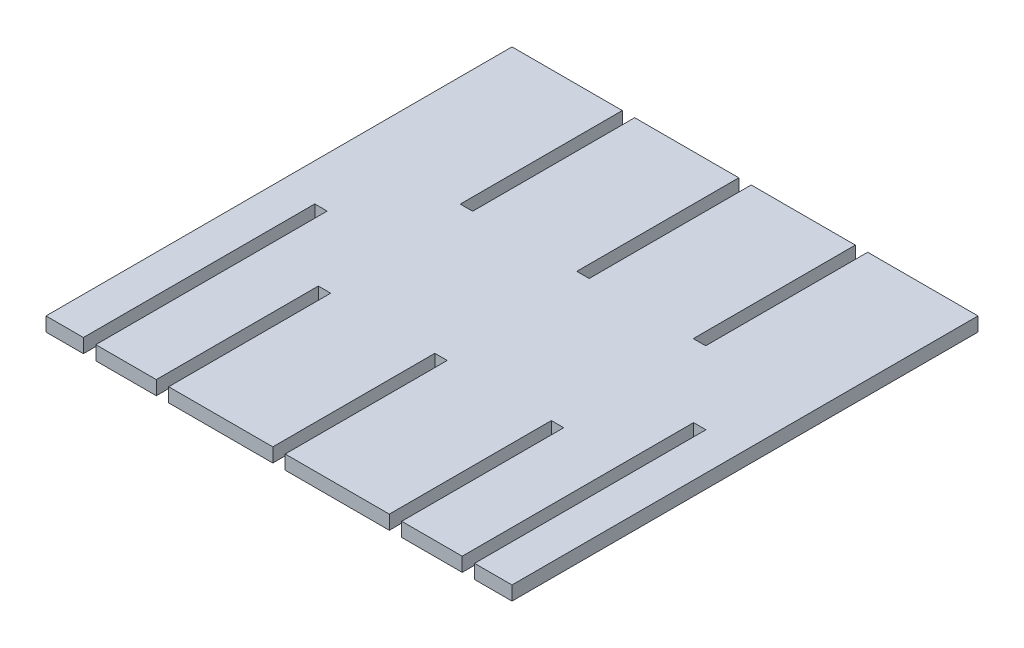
ISO-10303-21;
HEADER;
FILE_DESCRIPTION(('STEP AP214'),'2;1');
FILE_NAME('part.step','',(''),(''),'','','');
FILE_SCHEMA(('AUTOMOTIVE_DESIGN { 1 0 10303 214 1 1 1 1 }'));
ENDSEC;
DATA;
#1=APPLICATION_CONTEXT('core data for automotive mechanical design processes');
#2=APPLICATION_PROTOCOL_DEFINITION('international standard','automotive_design',2000,#1);
#3=PRODUCT_CONTEXT('',#1,'mechanical');
#4=PRODUCT('Part','Part','',(#3));
#5=PRODUCT_RELATED_PRODUCT_CATEGORY('part','',(#4));
#6=PRODUCT_DEFINITION_FORMATION('','',#4);
#7=PRODUCT_DEFINITION_CONTEXT('part definition',#1,'design');
#8=PRODUCT_DEFINITION('design','',#6,#7);
#9=PRODUCT_DEFINITION_SHAPE('','',#8);
#10=(LENGTH_UNIT() NAMED_UNIT(*) SI_UNIT(.MILLI.,.METRE.));
#11=(NAMED_UNIT(*) PLANE_ANGLE_UNIT() SI_UNIT($,.RADIAN.));
#12=(NAMED_UNIT(*) SI_UNIT($,.STERADIAN.) SOLID_ANGLE_UNIT());
#13=UNCERTAINTY_MEASURE_WITH_UNIT(LENGTH_MEASURE(1.E-05),#10,'distance_accuracy_value','');
#14=(GEOMETRIC_REPRESENTATION_CONTEXT(3) GLOBAL_UNCERTAINTY_ASSIGNED_CONTEXT((#13)) GLOBAL_UNIT_ASSIGNED_CONTEXT((#10,
#11,#12)) REPRESENTATION_CONTEXT('',''));
#15=CARTESIAN_POINT('',(0.,0.,0.));
#16=DIRECTION('',(0.,0.,1.));
#17=DIRECTION('',(1.,0.,0.));
#18=AXIS2_PLACEMENT_3D('',#15,#16,#17);
#19=CARTESIAN_POINT('',(0.,3.,0.));
#20=DIRECTION('',(1.,0.,0.));
#21=DIRECTION('',(0.,0.,-1.));
#22=AXIS2_PLACEMENT_3D('',#19,#20,#21);
#23=PLANE('',#22);
#24=DIRECTION('',(0.,0.,1.));
#25=VECTOR('',#24,1.);
#26=CARTESIAN_POINT('',(0.,0.,0.));
#27=LINE('',#26,#25);
#28=CARTESIAN_POINT('',(0.,0.,-99.65));
#29=VERTEX_POINT('',#28);
#30=CARTESIAN_POINT('',(0.,0.,0.));
#31=VERTEX_POINT('',#30);
#32=EDGE_CURVE('E305',#29,#31,#27,.T.);
#33=ORIENTED_EDGE('',*,*,#32,.T.);
#34=DIRECTION('',(0.,-1.,0.));
#35=VECTOR('',#34,1.);
#36=CARTESIAN_POINT('',(0.,3.,0.));
#37=LINE('',#36,#35);
#38=CARTESIAN_POINT('',(0.,3.,0.));
#39=VERTEX_POINT('',#38);
#40=EDGE_CURVE('E11',#39,#31,#37,.T.);
#41=ORIENTED_EDGE('',*,*,#40,.F.);
#42=DIRECTION('',(0.,0.,1.));
#43=VECTOR('',#42,1.);
#44=CARTESIAN_POINT('',(0.,3.,0.));
#45=LINE('',#44,#43);
#46=CARTESIAN_POINT('',(0.,3.,-99.65));
#47=VERTEX_POINT('',#46);
#48=EDGE_CURVE('E375',#47,#39,#45,.T.);
#49=ORIENTED_EDGE('',*,*,#48,.F.);
#50=DIRECTION('',(0.,-1.,0.));
#51=VECTOR('',#50,1.);
#52=CARTESIAN_POINT('',(0.,3.,-99.65));
#53=LINE('',#52,#51);
#54=EDGE_CURVE('E301',#47,#29,#53,.T.);
#55=ORIENTED_EDGE('',*,*,#54,.T.);
#56=EDGE_LOOP('',(#33,#41,#49,#55));
#57=FACE_BOUND('',#56,.T.);
#58=ADVANCED_FACE('F41',(#57),#23,.F.);
#59=CARTESIAN_POINT('',(0.,3.,0.));
#60=DIRECTION('',(0.,0.,-1.));
#61=DIRECTION('',(-1.,0.,0.));
#62=AXIS2_PLACEMENT_3D('',#59,#60,#61);
#63=PLANE('',#62);
#64=DIRECTION('',(1.,0.,0.));
#65=VECTOR('',#64,1.);
#66=CARTESIAN_POINT('',(0.,0.,0.));
#67=LINE('',#66,#65);
#68=CARTESIAN_POINT('',(7.99999999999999,0.,0.));
#69=VERTEX_POINT('',#68);
#70=EDGE_CURVE('E308',#31,#69,#67,.T.);
#71=ORIENTED_EDGE('',*,*,#70,.T.);
#72=DIRECTION('',(0.,-1.,0.));
#73=VECTOR('',#72,1.);
#74=CARTESIAN_POINT('',(7.99999999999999,3.,0.));
#75=LINE('',#74,#73);
#76=CARTESIAN_POINT('',(7.99999999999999,3.,0.));
#77=VERTEX_POINT('',#76);
#78=EDGE_CURVE('E49',#77,#69,#75,.T.);
#79=ORIENTED_EDGE('',*,*,#78,.F.);
#80=DIRECTION('',(1.,0.,0.));
#81=VECTOR('',#80,1.);
#82=CARTESIAN_POINT('',(0.,3.,0.));
#83=LINE('',#82,#81);
#84=EDGE_CURVE('E184',#39,#77,#83,.T.);
#85=ORIENTED_EDGE('',*,*,#84,.F.);
#86=ORIENTED_EDGE('',*,*,#40,.T.);
#87=EDGE_LOOP('',(#71,#79,#85,#86));
#88=FACE_BOUND('',#87,.T.);
#89=ADVANCED_FACE('F573',(#88),#63,.F.);
#90=CARTESIAN_POINT('',(7.99999999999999,3.,0.));
#91=DIRECTION('',(-1.,0.,0.));
#92=DIRECTION('',(0.,0.,1.));
#93=AXIS2_PLACEMENT_3D('',#90,#91,#92);
#94=PLANE('',#93);
#95=DIRECTION('',(0.,0.,-1.));
#96=VECTOR('',#95,1.);
#97=CARTESIAN_POINT('',(7.99999999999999,0.,0.));
#98=LINE('',#97,#96);
#99=CARTESIAN_POINT('',(7.99999999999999,0.,-49.475));
#100=VERTEX_POINT('',#99);
#101=EDGE_CURVE('E310',#69,#100,#98,.T.);
#102=ORIENTED_EDGE('',*,*,#101,.T.);
#103=DIRECTION('',(0.,-1.,0.));
#104=VECTOR('',#103,1.);
#105=CARTESIAN_POINT('',(7.99999999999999,3.,-49.475));
#106=LINE('',#105,#104);
#107=CARTESIAN_POINT('',(7.99999999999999,3.,-49.475));
#108=VERTEX_POINT('',#107);
#109=EDGE_CURVE('E466',#108,#100,#106,.T.);
#110=ORIENTED_EDGE('',*,*,#109,.F.);
#111=DIRECTION('',(0.,0.,-1.));
#112=VECTOR('',#111,1.);
#113=CARTESIAN_POINT('',(7.99999999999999,3.,0.));
#114=LINE('',#113,#112);
#115=EDGE_CURVE('E474',#77,#108,#114,.T.);
#116=ORIENTED_EDGE('',*,*,#115,.F.);
#117=ORIENTED_EDGE('',*,*,#78,.T.);
#118=EDGE_LOOP('',(#102,#110,#116,#117));
#119=FACE_BOUND('',#118,.T.);
#120=ADVANCED_FACE('F472',(#119),#94,.F.);
#121=CARTESIAN_POINT('',(7.99999999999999,3.,-49.475));
#122=DIRECTION('',(0.,0.,-1.));
#123=DIRECTION('',(-1.,0.,0.));
#124=AXIS2_PLACEMENT_3D('',#121,#122,#123);
#125=PLANE('',#124);
#126=DIRECTION('',(1.,0.,0.));
#127=VECTOR('',#126,1.);
#128=CARTESIAN_POINT('',(7.99999999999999,0.,-49.475));
#129=LINE('',#128,#127);
#130=CARTESIAN_POINT('',(10.65,0.,-49.475));
#131=VERTEX_POINT('',#130);
#132=EDGE_CURVE('E312',#100,#131,#129,.T.);
#133=ORIENTED_EDGE('',*,*,#132,.T.);
#134=DIRECTION('',(0.,-1.,0.));
#135=VECTOR('',#134,1.);
#136=CARTESIAN_POINT('',(10.65,3.,-49.475));
#137=LINE('',#136,#135);
#138=CARTESIAN_POINT('',(10.65,3.,-49.475));
#139=VERTEX_POINT('',#138);
#140=EDGE_CURVE('E463',#139,#131,#137,.T.);
#141=ORIENTED_EDGE('',*,*,#140,.F.);
#142=DIRECTION('',(1.,0.,0.));
#143=VECTOR('',#142,1.);
#144=CARTESIAN_POINT('',(7.99999999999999,3.,-49.475));
#145=LINE('',#144,#143);
#146=EDGE_CURVE('E492',#108,#139,#145,.T.);
#147=ORIENTED_EDGE('',*,*,#146,.F.);
#148=ORIENTED_EDGE('',*,*,#109,.T.);
#149=EDGE_LOOP('',(#133,#141,#147,#148));
#150=FACE_BOUND('',#149,.T.);
#151=ADVANCED_FACE('F483',(#150),#125,.F.);
#152=CARTESIAN_POINT('',(10.65,3.,0.));
#153=DIRECTION('',(1.,0.,0.));
#154=DIRECTION('',(0.,0.,-1.));
#155=AXIS2_PLACEMENT_3D('',#152,#153,#154);
#156=PLANE('',#155);
#157=DIRECTION('',(0.,0.,1.));
#158=VECTOR('',#157,1.);
#159=CARTESIAN_POINT('',(10.65,0.,0.));
#160=LINE('',#159,#158);
#161=CARTESIAN_POINT('',(10.65,0.,0.));
#162=VERTEX_POINT('',#161);
#163=EDGE_CURVE('E314',#131,#162,#160,.T.);
#164=ORIENTED_EDGE('',*,*,#163,.T.);
#165=DIRECTION('',(0.,-1.,0.));
#166=VECTOR('',#165,1.);
#167=CARTESIAN_POINT('',(10.65,3.,0.));
#168=LINE('',#167,#166);
#169=CARTESIAN_POINT('',(10.65,3.,0.));
#170=VERTEX_POINT('',#169);
#171=EDGE_CURVE('E460',#170,#162,#168,.T.);
#172=ORIENTED_EDGE('',*,*,#171,.F.);
#173=DIRECTION('',(0.,0.,1.));
#174=VECTOR('',#173,1.);
#175=CARTESIAN_POINT('',(10.65,3.,0.));
#176=LINE('',#175,#174);
#177=EDGE_CURVE('E489',#139,#170,#176,.T.);
#178=ORIENTED_EDGE('',*,*,#177,.F.);
#179=ORIENTED_EDGE('',*,*,#140,.T.);
#180=EDGE_LOOP('',(#164,#172,#178,#179));
#181=FACE_BOUND('',#180,.T.);
#182=ADVANCED_FACE('F487',(#181),#156,.F.);
#183=CARTESIAN_POINT('',(10.65,3.,0.));
#184=DIRECTION('',(0.,0.,-1.));
#185=DIRECTION('',(-1.,0.,0.));
#186=AXIS2_PLACEMENT_3D('',#183,#184,#185);
#187=PLANE('',#186);
#188=DIRECTION('',(1.,0.,0.));
#189=VECTOR('',#188,1.);
#190=CARTESIAN_POINT('',(10.65,0.,0.));
#191=LINE('',#190,#189);
#192=CARTESIAN_POINT('',(23.585,0.,1.73980515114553E-13));
#193=VERTEX_POINT('',#192);
#194=EDGE_CURVE('E316',#162,#193,#191,.T.);
#195=ORIENTED_EDGE('',*,*,#194,.T.);
#196=DIRECTION('',(0.,-1.,0.));
#197=VECTOR('',#196,1.);
#198=CARTESIAN_POINT('',(23.585,3.,1.73980515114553E-13));
#199=LINE('',#198,#197);
#200=CARTESIAN_POINT('',(23.585,3.,1.73980515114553E-13));
#201=VERTEX_POINT('',#200);
#202=EDGE_CURVE('E457',#201,#193,#199,.T.);
#203=ORIENTED_EDGE('',*,*,#202,.F.);
#204=DIRECTION('',(1.,0.,0.));
#205=VECTOR('',#204,1.);
#206=CARTESIAN_POINT('',(10.65,3.,0.));
#207=LINE('',#206,#205);
#208=EDGE_CURVE('E491',#170,#201,#207,.T.);
#209=ORIENTED_EDGE('',*,*,#208,.F.);
#210=ORIENTED_EDGE('',*,*,#171,.T.);
#211=EDGE_LOOP('',(#195,#203,#209,#210));
#212=FACE_BOUND('',#211,.T.);
#213=ADVANCED_FACE('F586',(#212),#187,.F.);
#214=CARTESIAN_POINT('',(23.585,3.,1.73980515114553E-13));
#215=DIRECTION('',(-1.,0.,0.));
#216=DIRECTION('',(0.,0.,1.));
#217=AXIS2_PLACEMENT_3D('',#214,#215,#216);
#218=PLANE('',#217);
#219=DIRECTION('',(0.,0.,-1.));
#220=VECTOR('',#219,1.);
#221=CARTESIAN_POINT('',(23.585,0.,1.73980515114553E-13));
#222=LINE('',#221,#220);
#223=CARTESIAN_POINT('',(23.585,0.,-34.6499999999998));
#224=VERTEX_POINT('',#223);
#225=EDGE_CURVE('E318',#193,#224,#222,.T.);
#226=ORIENTED_EDGE('',*,*,#225,.T.);
#227=DIRECTION('',(0.,-1.,0.));
#228=VECTOR('',#227,1.);
#229=CARTESIAN_POINT('',(23.585,3.,-34.6499999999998));
#230=LINE('',#229,#228);
#231=CARTESIAN_POINT('',(23.585,3.,-34.6499999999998));
#232=VERTEX_POINT('',#231);
#233=EDGE_CURVE('E454',#232,#224,#230,.T.);
#234=ORIENTED_EDGE('',*,*,#233,.F.);
#235=DIRECTION('',(0.,0.,-1.));
#236=VECTOR('',#235,1.);
#237=CARTESIAN_POINT('',(23.585,3.,1.73980515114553E-13));
#238=LINE('',#237,#236);
#239=EDGE_CURVE('E494',#201,#232,#238,.T.);
#240=ORIENTED_EDGE('',*,*,#239,.F.);
#241=ORIENTED_EDGE('',*,*,#202,.T.);
#242=EDGE_LOOP('',(#226,#234,#240,#241));
#243=FACE_BOUND('',#242,.T.);
#244=ADVANCED_FACE('F589',(#243),#218,.F.);
#245=CARTESIAN_POINT('',(26.235,3.,-34.6499999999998));
#246=DIRECTION('',(0.,0.,-1.));
#247=DIRECTION('',(-1.,0.,0.));
#248=AXIS2_PLACEMENT_3D('',#245,#246,#247);
#249=PLANE('',#248);
#250=DIRECTION('',(1.,0.,0.));
#251=VECTOR('',#250,1.);
#252=CARTESIAN_POINT('',(26.235,0.,-34.6499999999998));
#253=LINE('',#252,#251);
#254=CARTESIAN_POINT('',(26.235,0.,-34.6499999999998));
#255=VERTEX_POINT('',#254);
#256=EDGE_CURVE('E320',#224,#255,#253,.T.);
#257=ORIENTED_EDGE('',*,*,#256,.T.);
#258=DIRECTION('',(0.,-1.,0.));
#259=VECTOR('',#258,1.);
#260=CARTESIAN_POINT('',(26.235,3.,-34.6499999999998));
#261=LINE('',#260,#259);
#262=CARTESIAN_POINT('',(26.235,3.,-34.6499999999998));
#263=VERTEX_POINT('',#262);
#264=EDGE_CURVE('E451',#263,#255,#261,.T.);
#265=ORIENTED_EDGE('',*,*,#264,.F.);
#266=DIRECTION('',(1.,0.,0.));
#267=VECTOR('',#266,1.);
#268=CARTESIAN_POINT('',(26.235,3.,-34.6499999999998));
#269=LINE('',#268,#267);
#270=EDGE_CURVE('E500',#232,#263,#269,.T.);
#271=ORIENTED_EDGE('',*,*,#270,.F.);
#272=ORIENTED_EDGE('',*,*,#233,.T.);
#273=EDGE_LOOP('',(#257,#265,#271,#272));
#274=FACE_BOUND('',#273,.T.);
#275=ADVANCED_FACE('F593',(#274),#249,.F.);
#276=CARTESIAN_POINT('',(26.235,3.,1.73980515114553E-13));
#277=DIRECTION('',(1.,0.,0.));
#278=DIRECTION('',(0.,0.,-1.));
#279=AXIS2_PLACEMENT_3D('',#276,#277,#278);
#280=PLANE('',#279);
#281=DIRECTION('',(0.,0.,1.));
#282=VECTOR('',#281,1.);
#283=CARTESIAN_POINT('',(26.235,0.,1.73980515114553E-13));
#284=LINE('',#283,#282);
#285=CARTESIAN_POINT('',(26.235,0.,1.73980515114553E-13));
#286=VERTEX_POINT('',#285);
#287=EDGE_CURVE('E322',#255,#286,#284,.T.);
#288=ORIENTED_EDGE('',*,*,#287,.T.);
#289=DIRECTION('',(0.,-1.,0.));
#290=VECTOR('',#289,1.);
#291=CARTESIAN_POINT('',(26.235,3.,1.73980515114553E-13));
#292=LINE('',#291,#290);
#293=CARTESIAN_POINT('',(26.235,3.,1.73980515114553E-13));
#294=VERTEX_POINT('',#293);
#295=EDGE_CURVE('E448',#294,#286,#292,.T.);
#296=ORIENTED_EDGE('',*,*,#295,.F.);
#297=DIRECTION('',(0.,0.,1.));
#298=VECTOR('',#297,1.);
#299=CARTESIAN_POINT('',(26.235,3.,1.73980515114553E-13));
#300=LINE('',#299,#298);
#301=EDGE_CURVE('E502',#263,#294,#300,.T.);
#302=ORIENTED_EDGE('',*,*,#301,.F.);
#303=ORIENTED_EDGE('',*,*,#264,.T.);
#304=EDGE_LOOP('',(#288,#296,#302,#303));
#305=FACE_BOUND('',#304,.T.);
#306=ADVANCED_FACE('F597',(#305),#280,.F.);
#307=CARTESIAN_POINT('',(26.235,3.,1.73980515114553E-13));
#308=DIRECTION('',(0.,0.,-1.));
#309=DIRECTION('',(-1.,0.,0.));
#310=AXIS2_PLACEMENT_3D('',#307,#308,#309);
#311=PLANE('',#310);
#312=DIRECTION('',(1.,0.,0.));
#313=VECTOR('',#312,1.);
#314=CARTESIAN_POINT('',(26.235,0.,1.73980515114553E-13));
#315=LINE('',#314,#313);
#316=CARTESIAN_POINT('',(48.5,0.,0.));
#317=VERTEX_POINT('',#316);
#318=EDGE_CURVE('E324',#286,#317,#315,.T.);
#319=ORIENTED_EDGE('',*,*,#318,.T.);
#320=DIRECTION('',(0.,-1.,0.));
#321=VECTOR('',#320,1.);
#322=CARTESIAN_POINT('',(48.5,3.,0.));
#323=LINE('',#322,#321);
#324=CARTESIAN_POINT('',(48.5,3.,0.));
#325=VERTEX_POINT('',#324);
#326=EDGE_CURVE('E445',#325,#317,#323,.T.);
#327=ORIENTED_EDGE('',*,*,#326,.F.);
#328=DIRECTION('',(1.,0.,0.));
#329=VECTOR('',#328,1.);
#330=CARTESIAN_POINT('',(26.235,3.,1.73980515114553E-13));
#331=LINE('',#330,#329);
#332=EDGE_CURVE('E504',#294,#325,#331,.T.);
#333=ORIENTED_EDGE('',*,*,#332,.F.);
#334=ORIENTED_EDGE('',*,*,#295,.T.);
#335=EDGE_LOOP('',(#319,#327,#333,#334));
#336=FACE_BOUND('',#335,.T.);
#337=ADVANCED_FACE('F601',(#336),#311,.F.);
#338=CARTESIAN_POINT('',(48.5,3.,0.));
#339=DIRECTION('',(-1.,0.,0.));
#340=DIRECTION('',(0.,0.,1.));
#341=AXIS2_PLACEMENT_3D('',#338,#339,#340);
#342=PLANE('',#341);
#343=DIRECTION('',(0.,0.,-1.));
#344=VECTOR('',#343,1.);
#345=CARTESIAN_POINT('',(48.5,0.,0.));
#346=LINE('',#345,#344);
#347=CARTESIAN_POINT('',(48.5,0.,-34.65));
#348=VERTEX_POINT('',#347);
#349=EDGE_CURVE('E326',#317,#348,#346,.T.);
#350=ORIENTED_EDGE('',*,*,#349,.T.);
#351=DIRECTION('',(0.,-1.,0.));
#352=VECTOR('',#351,1.);
#353=CARTESIAN_POINT('',(48.5,3.,-34.65));
#354=LINE('',#353,#352);
#355=CARTESIAN_POINT('',(48.5,3.,-34.65));
#356=VERTEX_POINT('',#355);
#357=EDGE_CURVE('E442',#356,#348,#354,.T.);
#358=ORIENTED_EDGE('',*,*,#357,.F.);
#359=DIRECTION('',(0.,0.,-1.));
#360=VECTOR('',#359,1.);
#361=CARTESIAN_POINT('',(48.5,3.,0.));
#362=LINE('',#361,#360);
#363=EDGE_CURVE('E506',#325,#356,#362,.T.);
#364=ORIENTED_EDGE('',*,*,#363,.F.);
#365=ORIENTED_EDGE('',*,*,#326,.T.);
#366=EDGE_LOOP('',(#350,#358,#364,#365));
#367=FACE_BOUND('',#366,.T.);
#368=ADVANCED_FACE('F605',(#367),#342,.F.);
#369=CARTESIAN_POINT('',(51.15,3.,-34.65));
#370=DIRECTION('',(0.,0.,-1.));
#371=DIRECTION('',(-1.,0.,0.));
#372=AXIS2_PLACEMENT_3D('',#369,#370,#371);
#373=PLANE('',#372);
#374=DIRECTION('',(1.,0.,0.));
#375=VECTOR('',#374,1.);
#376=CARTESIAN_POINT('',(51.15,0.,-34.65));
#377=LINE('',#376,#375);
#378=CARTESIAN_POINT('',(51.15,0.,-34.65));
#379=VERTEX_POINT('',#378);
#380=EDGE_CURVE('E328',#348,#379,#377,.T.);
#381=ORIENTED_EDGE('',*,*,#380,.T.);
#382=DIRECTION('',(0.,-1.,0.));
#383=VECTOR('',#382,1.);
#384=CARTESIAN_POINT('',(51.15,3.,-34.65));
#385=LINE('',#384,#383);
#386=CARTESIAN_POINT('',(51.15,3.,-34.65));
#387=VERTEX_POINT('',#386);
#388=EDGE_CURVE('E439',#387,#379,#385,.T.);
#389=ORIENTED_EDGE('',*,*,#388,.F.);
#390=DIRECTION('',(1.,0.,0.));
#391=VECTOR('',#390,1.);
#392=CARTESIAN_POINT('',(51.15,3.,-34.65));
#393=LINE('',#392,#391);
#394=EDGE_CURVE('E508',#356,#387,#393,.T.);
#395=ORIENTED_EDGE('',*,*,#394,.F.);
#396=ORIENTED_EDGE('',*,*,#357,.T.);
#397=EDGE_LOOP('',(#381,#389,#395,#396));
#398=FACE_BOUND('',#397,.T.);
#399=ADVANCED_FACE('F609',(#398),#373,.F.);
#400=CARTESIAN_POINT('',(51.15,3.,0.));
#401=DIRECTION('',(1.,0.,0.));
#402=DIRECTION('',(0.,0.,-1.));
#403=AXIS2_PLACEMENT_3D('',#400,#401,#402);
#404=PLANE('',#403);
#405=DIRECTION('',(0.,0.,1.));
#406=VECTOR('',#405,1.);
#407=CARTESIAN_POINT('',(51.15,0.,0.));
#408=LINE('',#407,#406);
#409=CARTESIAN_POINT('',(51.15,0.,0.));
#410=VERTEX_POINT('',#409);
#411=EDGE_CURVE('E330',#379,#410,#408,.T.);
#412=ORIENTED_EDGE('',*,*,#411,.T.);
#413=DIRECTION('',(0.,-1.,0.));
#414=VECTOR('',#413,1.);
#415=CARTESIAN_POINT('',(51.15,3.,0.));
#416=LINE('',#415,#414);
#417=CARTESIAN_POINT('',(51.15,3.,0.));
#418=VERTEX_POINT('',#417);
#419=EDGE_CURVE('E436',#418,#410,#416,.T.);
#420=ORIENTED_EDGE('',*,*,#419,.F.);
#421=DIRECTION('',(0.,0.,1.));
#422=VECTOR('',#421,1.);
#423=CARTESIAN_POINT('',(51.15,3.,0.));
#424=LINE('',#423,#422);
#425=EDGE_CURVE('E510',#387,#418,#424,.T.);
#426=ORIENTED_EDGE('',*,*,#425,.F.);
#427=ORIENTED_EDGE('',*,*,#388,.T.);
#428=EDGE_LOOP('',(#412,#420,#426,#427));
#429=FACE_BOUND('',#428,.T.);
#430=ADVANCED_FACE('F613',(#429),#404,.F.);
#431=CARTESIAN_POINT('',(51.15,3.,0.));
#432=DIRECTION('',(0.,0.,-1.));
#433=DIRECTION('',(-1.,0.,0.));
#434=AXIS2_PLACEMENT_3D('',#431,#432,#433);
#435=PLANE('',#434);
#436=DIRECTION('',(1.,0.,0.));
#437=VECTOR('',#436,1.);
#438=CARTESIAN_POINT('',(51.15,0.,0.));
#439=LINE('',#438,#437);
#440=CARTESIAN_POINT('',(73.415,0.,0.));
#441=VERTEX_POINT('',#440);
#442=EDGE_CURVE('E332',#410,#441,#439,.T.);
#443=ORIENTED_EDGE('',*,*,#442,.T.);
#444=DIRECTION('',(0.,-1.,0.));
#445=VECTOR('',#444,1.);
#446=CARTESIAN_POINT('',(73.415,3.,0.));
#447=LINE('',#446,#445);
#448=CARTESIAN_POINT('',(73.415,3.,0.));
#449=VERTEX_POINT('',#448);
#450=EDGE_CURVE('E433',#449,#441,#447,.T.);
#451=ORIENTED_EDGE('',*,*,#450,.F.);
#452=DIRECTION('',(1.,0.,0.));
#453=VECTOR('',#452,1.);
#454=CARTESIAN_POINT('',(51.15,3.,0.));
#455=LINE('',#454,#453);
#456=EDGE_CURVE('E512',#418,#449,#455,.T.);
#457=ORIENTED_EDGE('',*,*,#456,.F.);
#458=ORIENTED_EDGE('',*,*,#419,.T.);
#459=EDGE_LOOP('',(#443,#451,#457,#458));
#460=FACE_BOUND('',#459,.T.);
#461=ADVANCED_FACE('F617',(#460),#435,.F.);
#462=CARTESIAN_POINT('',(73.415,3.,0.));
#463=DIRECTION('',(-1.,0.,0.));
#464=DIRECTION('',(0.,0.,1.));
#465=AXIS2_PLACEMENT_3D('',#462,#463,#464);
#466=PLANE('',#465);
#467=DIRECTION('',(0.,0.,-1.));
#468=VECTOR('',#467,1.);
#469=CARTESIAN_POINT('',(73.415,0.,0.));
#470=LINE('',#469,#468);
#471=CARTESIAN_POINT('',(73.415,0.,-34.65));
#472=VERTEX_POINT('',#471);
#473=EDGE_CURVE('E334',#441,#472,#470,.T.);
#474=ORIENTED_EDGE('',*,*,#473,.T.);
#475=DIRECTION('',(0.,-1.,0.));
#476=VECTOR('',#475,1.);
#477=CARTESIAN_POINT('',(73.415,3.,-34.65));
#478=LINE('',#477,#476);
#479=CARTESIAN_POINT('',(73.415,3.,-34.65));
#480=VERTEX_POINT('',#479);
#481=EDGE_CURVE('E430',#480,#472,#478,.T.);
#482=ORIENTED_EDGE('',*,*,#481,.F.);
#483=DIRECTION('',(0.,0.,-1.));
#484=VECTOR('',#483,1.);
#485=CARTESIAN_POINT('',(73.415,3.,0.));
#486=LINE('',#485,#484);
#487=EDGE_CURVE('E514',#449,#480,#486,.T.);
#488=ORIENTED_EDGE('',*,*,#487,.F.);
#489=ORIENTED_EDGE('',*,*,#450,.T.);
#490=EDGE_LOOP('',(#474,#482,#488,#489));
#491=FACE_BOUND('',#490,.T.);
#492=ADVANCED_FACE('F621',(#491),#466,.F.);
#493=CARTESIAN_POINT('',(76.065,3.,-34.65));
#494=DIRECTION('',(0.,0.,-1.));
#495=DIRECTION('',(-1.,0.,0.));
#496=AXIS2_PLACEMENT_3D('',#493,#494,#495);
#497=PLANE('',#496);
#498=DIRECTION('',(1.,0.,0.));
#499=VECTOR('',#498,1.);
#500=CARTESIAN_POINT('',(76.065,0.,-34.65));
#501=LINE('',#500,#499);
#502=CARTESIAN_POINT('',(76.065,0.,-34.65));
#503=VERTEX_POINT('',#502);
#504=EDGE_CURVE('E336',#472,#503,#501,.T.);
#505=ORIENTED_EDGE('',*,*,#504,.T.);
#506=DIRECTION('',(0.,-1.,0.));
#507=VECTOR('',#506,1.);
#508=CARTESIAN_POINT('',(76.065,3.,-34.65));
#509=LINE('',#508,#507);
#510=CARTESIAN_POINT('',(76.065,3.,-34.65));
#511=VERTEX_POINT('',#510);
#512=EDGE_CURVE('E427',#511,#503,#509,.T.);
#513=ORIENTED_EDGE('',*,*,#512,.F.);
#514=DIRECTION('',(1.,0.,0.));
#515=VECTOR('',#514,1.);
#516=CARTESIAN_POINT('',(76.065,3.,-34.65));
#517=LINE('',#516,#515);
#518=EDGE_CURVE('E516',#480,#511,#517,.T.);
#519=ORIENTED_EDGE('',*,*,#518,.F.);
#520=ORIENTED_EDGE('',*,*,#481,.T.);
#521=EDGE_LOOP('',(#505,#513,#519,#520));
#522=FACE_BOUND('',#521,.T.);
#523=ADVANCED_FACE('F625',(#522),#497,.F.);
#524=CARTESIAN_POINT('',(76.065,3.,0.));
#525=DIRECTION('',(1.,0.,0.));
#526=DIRECTION('',(0.,0.,-1.));
#527=AXIS2_PLACEMENT_3D('',#524,#525,#526);
#528=PLANE('',#527);
#529=DIRECTION('',(0.,0.,1.));
#530=VECTOR('',#529,1.);
#531=CARTESIAN_POINT('',(76.065,0.,0.));
#532=LINE('',#531,#530);
#533=CARTESIAN_POINT('',(76.065,0.,0.));
#534=VERTEX_POINT('',#533);
#535=EDGE_CURVE('E338',#503,#534,#532,.T.);
#536=ORIENTED_EDGE('',*,*,#535,.T.);
#537=DIRECTION('',(0.,-1.,0.));
#538=VECTOR('',#537,1.);
#539=CARTESIAN_POINT('',(76.065,3.,0.));
#540=LINE('',#539,#538);
#541=CARTESIAN_POINT('',(76.065,3.,0.));
#542=VERTEX_POINT('',#541);
#543=EDGE_CURVE('E424',#542,#534,#540,.T.);
#544=ORIENTED_EDGE('',*,*,#543,.F.);
#545=DIRECTION('',(0.,0.,1.));
#546=VECTOR('',#545,1.);
#547=CARTESIAN_POINT('',(76.065,3.,0.));
#548=LINE('',#547,#546);
#549=EDGE_CURVE('E518',#511,#542,#548,.T.);
#550=ORIENTED_EDGE('',*,*,#549,.F.);
#551=ORIENTED_EDGE('',*,*,#512,.T.);
#552=EDGE_LOOP('',(#536,#544,#550,#551));
#553=FACE_BOUND('',#552,.T.);
#554=ADVANCED_FACE('F629',(#553),#528,.F.);
#555=CARTESIAN_POINT('',(76.065,3.,0.));
#556=DIRECTION('',(0.,0.,-1.));
#557=DIRECTION('',(-1.,0.,0.));
#558=AXIS2_PLACEMENT_3D('',#555,#556,#557);
#559=PLANE('',#558);
#560=DIRECTION('',(1.,0.,0.));
#561=VECTOR('',#560,1.);
#562=CARTESIAN_POINT('',(76.065,0.,0.));
#563=LINE('',#562,#561);
#564=CARTESIAN_POINT('',(89.,0.,0.));
#565=VERTEX_POINT('',#564);
#566=EDGE_CURVE('E340',#534,#565,#563,.T.);
#567=ORIENTED_EDGE('',*,*,#566,.T.);
#568=DIRECTION('',(0.,-1.,0.));
#569=VECTOR('',#568,1.);
#570=CARTESIAN_POINT('',(89.,3.,0.));
#571=LINE('',#570,#569);
#572=CARTESIAN_POINT('',(89.,3.,0.));
#573=VERTEX_POINT('',#572);
#574=EDGE_CURVE('E421',#573,#565,#571,.T.);
#575=ORIENTED_EDGE('',*,*,#574,.F.);
#576=DIRECTION('',(1.,0.,0.));
#577=VECTOR('',#576,1.);
#578=CARTESIAN_POINT('',(76.065,3.,0.));
#579=LINE('',#578,#577);
#580=EDGE_CURVE('E520',#542,#573,#579,.T.);
#581=ORIENTED_EDGE('',*,*,#580,.F.);
#582=ORIENTED_EDGE('',*,*,#543,.T.);
#583=EDGE_LOOP('',(#567,#575,#581,#582));
#584=FACE_BOUND('',#583,.T.);
#585=ADVANCED_FACE('F633',(#584),#559,.F.);
#586=CARTESIAN_POINT('',(89.,3.,0.));
#587=DIRECTION('',(-1.,0.,0.));
#588=DIRECTION('',(0.,0.,1.));
#589=AXIS2_PLACEMENT_3D('',#586,#587,#588);
#590=PLANE('',#589);
#591=DIRECTION('',(0.,0.,-1.));
#592=VECTOR('',#591,1.);
#593=CARTESIAN_POINT('',(89.,0.,0.));
#594=LINE('',#593,#592);
#595=CARTESIAN_POINT('',(89.,0.,-49.475));
#596=VERTEX_POINT('',#595);
#597=EDGE_CURVE('E342',#565,#596,#594,.T.);
#598=ORIENTED_EDGE('',*,*,#597,.T.);
#599=DIRECTION('',(0.,-1.,0.));
#600=VECTOR('',#599,1.);
#601=CARTESIAN_POINT('',(89.,3.,-49.475));
#602=LINE('',#601,#600);
#603=CARTESIAN_POINT('',(89.,3.,-49.475));
#604=VERTEX_POINT('',#603);
#605=EDGE_CURVE('E418',#604,#596,#602,.T.);
#606=ORIENTED_EDGE('',*,*,#605,.F.);
#607=DIRECTION('',(0.,0.,-1.));
#608=VECTOR('',#607,1.);
#609=CARTESIAN_POINT('',(89.,3.,0.));
#610=LINE('',#609,#608);
#611=EDGE_CURVE('E522',#573,#604,#610,.T.);
#612=ORIENTED_EDGE('',*,*,#611,.F.);
#613=ORIENTED_EDGE('',*,*,#574,.T.);
#614=EDGE_LOOP('',(#598,#606,#612,#613));
#615=FACE_BOUND('',#614,.T.);
#616=ADVANCED_FACE('F637',(#615),#590,.F.);
#617=CARTESIAN_POINT('',(91.65,3.,-49.475));
#618=DIRECTION('',(0.,0.,-1.));
#619=DIRECTION('',(-1.,0.,0.));
#620=AXIS2_PLACEMENT_3D('',#617,#618,#619);
#621=PLANE('',#620);
#622=DIRECTION('',(1.,0.,0.));
#623=VECTOR('',#622,1.);
#624=CARTESIAN_POINT('',(91.65,0.,-49.475));
#625=LINE('',#624,#623);
#626=CARTESIAN_POINT('',(91.65,0.,-49.475));
#627=VERTEX_POINT('',#626);
#628=EDGE_CURVE('E344',#596,#627,#625,.T.);
#629=ORIENTED_EDGE('',*,*,#628,.T.);
#630=DIRECTION('',(0.,-1.,0.));
#631=VECTOR('',#630,1.);
#632=CARTESIAN_POINT('',(91.65,3.,-49.475));
#633=LINE('',#632,#631);
#634=CARTESIAN_POINT('',(91.65,3.,-49.475));
#635=VERTEX_POINT('',#634);
#636=EDGE_CURVE('E415',#635,#627,#633,.T.);
#637=ORIENTED_EDGE('',*,*,#636,.F.);
#638=DIRECTION('',(1.,0.,0.));
#639=VECTOR('',#638,1.);
#640=CARTESIAN_POINT('',(91.65,3.,-49.475));
#641=LINE('',#640,#639);
#642=EDGE_CURVE('E524',#604,#635,#641,.T.);
#643=ORIENTED_EDGE('',*,*,#642,.F.);
#644=ORIENTED_EDGE('',*,*,#605,.T.);
#645=EDGE_LOOP('',(#629,#637,#643,#644));
#646=FACE_BOUND('',#645,.T.);
#647=ADVANCED_FACE('F641',(#646),#621,.F.);
#648=CARTESIAN_POINT('',(91.65,3.,0.));
#649=DIRECTION('',(1.,0.,0.));
#650=DIRECTION('',(0.,0.,-1.));
#651=AXIS2_PLACEMENT_3D('',#648,#649,#650);
#652=PLANE('',#651);
#653=DIRECTION('',(0.,0.,1.));
#654=VECTOR('',#653,1.);
#655=CARTESIAN_POINT('',(91.65,0.,0.));
#656=LINE('',#655,#654);
#657=CARTESIAN_POINT('',(91.65,0.,0.));
#658=VERTEX_POINT('',#657);
#659=EDGE_CURVE('E346',#627,#658,#656,.T.);
#660=ORIENTED_EDGE('',*,*,#659,.T.);
#661=DIRECTION('',(0.,-1.,0.));
#662=VECTOR('',#661,1.);
#663=CARTESIAN_POINT('',(91.65,3.,0.));
#664=LINE('',#663,#662);
#665=CARTESIAN_POINT('',(91.65,3.,0.));
#666=VERTEX_POINT('',#665);
#667=EDGE_CURVE('E412',#666,#658,#664,.T.);
#668=ORIENTED_EDGE('',*,*,#667,.F.);
#669=DIRECTION('',(0.,0.,1.));
#670=VECTOR('',#669,1.);
#671=CARTESIAN_POINT('',(91.65,3.,0.));
#672=LINE('',#671,#670);
#673=EDGE_CURVE('E526',#635,#666,#672,.T.);
#674=ORIENTED_EDGE('',*,*,#673,.F.);
#675=ORIENTED_EDGE('',*,*,#636,.T.);
#676=EDGE_LOOP('',(#660,#668,#674,#675));
#677=FACE_BOUND('',#676,.T.);
#678=ADVANCED_FACE('F645',(#677),#652,.F.);
#679=CARTESIAN_POINT('',(91.65,3.,0.));
#680=DIRECTION('',(0.,0.,-1.));
#681=DIRECTION('',(-1.,0.,0.));
#682=AXIS2_PLACEMENT_3D('',#679,#680,#681);
#683=PLANE('',#682);
#684=DIRECTION('',(1.,0.,0.));
#685=VECTOR('',#684,1.);
#686=CARTESIAN_POINT('',(91.65,0.,0.));
#687=LINE('',#686,#685);
#688=CARTESIAN_POINT('',(99.65,0.,0.));
#689=VERTEX_POINT('',#688);
#690=EDGE_CURVE('E348',#658,#689,#687,.T.);
#691=ORIENTED_EDGE('',*,*,#690,.T.);
#692=DIRECTION('',(0.,-1.,0.));
#693=VECTOR('',#692,1.);
#694=CARTESIAN_POINT('',(99.65,3.,0.));
#695=LINE('',#694,#693);
#696=CARTESIAN_POINT('',(99.65,3.,0.));
#697=VERTEX_POINT('',#696);
#698=EDGE_CURVE('E409',#697,#689,#695,.T.);
#699=ORIENTED_EDGE('',*,*,#698,.F.);
#700=DIRECTION('',(1.,0.,0.));
#701=VECTOR('',#700,1.);
#702=CARTESIAN_POINT('',(91.65,3.,0.));
#703=LINE('',#702,#701);
#704=EDGE_CURVE('E528',#666,#697,#703,.T.);
#705=ORIENTED_EDGE('',*,*,#704,.F.);
#706=ORIENTED_EDGE('',*,*,#667,.T.);
#707=EDGE_LOOP('',(#691,#699,#705,#706));
#708=FACE_BOUND('',#707,.T.);
#709=ADVANCED_FACE('F649',(#708),#683,.F.);
#710=CARTESIAN_POINT('',(99.65,3.,0.));
#711=DIRECTION('',(-1.,0.,0.));
#712=DIRECTION('',(0.,0.,1.));
#713=AXIS2_PLACEMENT_3D('',#710,#711,#712);
#714=PLANE('',#713);
#715=DIRECTION('',(0.,0.,-1.));
#716=VECTOR('',#715,1.);
#717=CARTESIAN_POINT('',(99.65,0.,0.));
#718=LINE('',#717,#716);
#719=CARTESIAN_POINT('',(99.65,0.,-99.65));
#720=VERTEX_POINT('',#719);
#721=EDGE_CURVE('E350',#689,#720,#718,.T.);
#722=ORIENTED_EDGE('',*,*,#721,.T.);
#723=DIRECTION('',(0.,-1.,0.));
#724=VECTOR('',#723,1.);
#725=CARTESIAN_POINT('',(99.65,3.,-99.65));
#726=LINE('',#725,#724);
#727=CARTESIAN_POINT('',(99.65,3.,-99.65));
#728=VERTEX_POINT('',#727);
#729=EDGE_CURVE('E406',#728,#720,#726,.T.);
#730=ORIENTED_EDGE('',*,*,#729,.F.);
#731=DIRECTION('',(0.,0.,-1.));
#732=VECTOR('',#731,1.);
#733=CARTESIAN_POINT('',(99.65,3.,0.));
#734=LINE('',#733,#732);
#735=EDGE_CURVE('E530',#697,#728,#734,.T.);
#736=ORIENTED_EDGE('',*,*,#735,.F.);
#737=ORIENTED_EDGE('',*,*,#698,.T.);
#738=EDGE_LOOP('',(#722,#730,#736,#737));
#739=FACE_BOUND('',#738,.T.);
#740=ADVANCED_FACE('F653',(#739),#714,.F.);
#741=CARTESIAN_POINT('',(76.065,3.,-99.65));
#742=DIRECTION('',(0.,0.,1.));
#743=DIRECTION('',(1.,0.,0.));
#744=AXIS2_PLACEMENT_3D('',#741,#742,#743);
#745=PLANE('',#744);
#746=DIRECTION('',(-1.,0.,0.));
#747=VECTOR('',#746,1.);
#748=CARTESIAN_POINT('',(76.065,0.,-99.65));
#749=LINE('',#748,#747);
#750=CARTESIAN_POINT('',(76.065,0.,-99.65));
#751=VERTEX_POINT('',#750);
#752=EDGE_CURVE('E352',#720,#751,#749,.T.);
#753=ORIENTED_EDGE('',*,*,#752,.T.);
#754=DIRECTION('',(0.,-1.,0.));
#755=VECTOR('',#754,1.);
#756=CARTESIAN_POINT('',(76.065,3.,-99.65));
#757=LINE('',#756,#755);
#758=CARTESIAN_POINT('',(76.065,3.,-99.65));
#759=VERTEX_POINT('',#758);
#760=EDGE_CURVE('E403',#759,#751,#757,.T.);
#761=ORIENTED_EDGE('',*,*,#760,.F.);
#762=DIRECTION('',(-1.,0.,0.));
#763=VECTOR('',#762,1.);
#764=CARTESIAN_POINT('',(76.065,3.,-99.65));
#765=LINE('',#764,#763);
#766=EDGE_CURVE('E532',#728,#759,#765,.T.);
#767=ORIENTED_EDGE('',*,*,#766,.F.);
#768=ORIENTED_EDGE('',*,*,#729,.T.);
#769=EDGE_LOOP('',(#753,#761,#767,#768));
#770=FACE_BOUND('',#769,.T.);
#771=ADVANCED_FACE('F657',(#770),#745,.F.);
#772=CARTESIAN_POINT('',(76.065,3.,-99.65));
#773=DIRECTION('',(1.,0.,0.));
#774=DIRECTION('',(0.,0.,-1.));
#775=AXIS2_PLACEMENT_3D('',#772,#773,#774);
#776=PLANE('',#775);
#777=DIRECTION('',(0.,0.,1.));
#778=VECTOR('',#777,1.);
#779=CARTESIAN_POINT('',(76.065,0.,-99.65));
#780=LINE('',#779,#778);
#781=CARTESIAN_POINT('',(76.065,0.,-65.));
#782=VERTEX_POINT('',#781);
#783=EDGE_CURVE('E354',#751,#782,#780,.T.);
#784=ORIENTED_EDGE('',*,*,#783,.T.);
#785=DIRECTION('',(0.,-1.,0.));
#786=VECTOR('',#785,1.);
#787=CARTESIAN_POINT('',(76.065,3.,-65.));
#788=LINE('',#787,#786);
#789=CARTESIAN_POINT('',(76.065,3.,-65.));
#790=VERTEX_POINT('',#789);
#791=EDGE_CURVE('E400',#790,#782,#788,.T.);
#792=ORIENTED_EDGE('',*,*,#791,.F.);
#793=DIRECTION('',(0.,0.,1.));
#794=VECTOR('',#793,1.);
#795=CARTESIAN_POINT('',(76.065,3.,-99.65));
#796=LINE('',#795,#794);
#797=EDGE_CURVE('E534',#759,#790,#796,.T.);
#798=ORIENTED_EDGE('',*,*,#797,.F.);
#799=ORIENTED_EDGE('',*,*,#760,.T.);
#800=EDGE_LOOP('',(#784,#792,#798,#799));
#801=FACE_BOUND('',#800,.T.);
#802=ADVANCED_FACE('F661',(#801),#776,.F.);
#803=CARTESIAN_POINT('',(73.415,3.,-65.));
#804=DIRECTION('',(0.,0.,1.));
#805=DIRECTION('',(1.,0.,0.));
#806=AXIS2_PLACEMENT_3D('',#803,#804,#805);
#807=PLANE('',#806);
#808=DIRECTION('',(-1.,0.,0.));
#809=VECTOR('',#808,1.);
#810=CARTESIAN_POINT('',(73.415,0.,-65.));
#811=LINE('',#810,#809);
#812=CARTESIAN_POINT('',(73.415,0.,-65.));
#813=VERTEX_POINT('',#812);
#814=EDGE_CURVE('E356',#782,#813,#811,.T.);
#815=ORIENTED_EDGE('',*,*,#814,.T.);
#816=DIRECTION('',(0.,-1.,0.));
#817=VECTOR('',#816,1.);
#818=CARTESIAN_POINT('',(73.415,3.,-65.));
#819=LINE('',#818,#817);
#820=CARTESIAN_POINT('',(73.415,3.,-65.));
#821=VERTEX_POINT('',#820);
#822=EDGE_CURVE('E397',#821,#813,#819,.T.);
#823=ORIENTED_EDGE('',*,*,#822,.F.);
#824=DIRECTION('',(-1.,0.,0.));
#825=VECTOR('',#824,1.);
#826=CARTESIAN_POINT('',(73.415,3.,-65.));
#827=LINE('',#826,#825);
#828=EDGE_CURVE('E536',#790,#821,#827,.T.);
#829=ORIENTED_EDGE('',*,*,#828,.F.);
#830=ORIENTED_EDGE('',*,*,#791,.T.);
#831=EDGE_LOOP('',(#815,#823,#829,#830));
#832=FACE_BOUND('',#831,.T.);
#833=ADVANCED_FACE('F665',(#832),#807,.F.);
#834=CARTESIAN_POINT('',(73.415,3.,-99.65));
#835=DIRECTION('',(-1.,0.,0.));
#836=DIRECTION('',(0.,0.,1.));
#837=AXIS2_PLACEMENT_3D('',#834,#835,#836);
#838=PLANE('',#837);
#839=DIRECTION('',(0.,0.,-1.));
#840=VECTOR('',#839,1.);
#841=CARTESIAN_POINT('',(73.415,0.,-99.65));
#842=LINE('',#841,#840);
#843=CARTESIAN_POINT('',(73.415,0.,-99.65));
#844=VERTEX_POINT('',#843);
#845=EDGE_CURVE('E358',#813,#844,#842,.T.);
#846=ORIENTED_EDGE('',*,*,#845,.T.);
#847=DIRECTION('',(0.,-1.,0.));
#848=VECTOR('',#847,1.);
#849=CARTESIAN_POINT('',(73.415,3.,-99.65));
#850=LINE('',#849,#848);
#851=CARTESIAN_POINT('',(73.415,3.,-99.65));
#852=VERTEX_POINT('',#851);
#853=EDGE_CURVE('E394',#852,#844,#850,.T.);
#854=ORIENTED_EDGE('',*,*,#853,.F.);
#855=DIRECTION('',(0.,0.,-1.));
#856=VECTOR('',#855,1.);
#857=CARTESIAN_POINT('',(73.415,3.,-99.65));
#858=LINE('',#857,#856);
#859=EDGE_CURVE('E538',#821,#852,#858,.T.);
#860=ORIENTED_EDGE('',*,*,#859,.F.);
#861=ORIENTED_EDGE('',*,*,#822,.T.);
#862=EDGE_LOOP('',(#846,#854,#860,#861));
#863=FACE_BOUND('',#862,.T.);
#864=ADVANCED_FACE('F669',(#863),#838,.F.);
#865=CARTESIAN_POINT('',(51.15,3.,-99.65));
#866=DIRECTION('',(0.,0.,1.));
#867=DIRECTION('',(1.,0.,0.));
#868=AXIS2_PLACEMENT_3D('',#865,#866,#867);
#869=PLANE('',#868);
#870=DIRECTION('',(-1.,0.,0.));
#871=VECTOR('',#870,1.);
#872=CARTESIAN_POINT('',(51.15,0.,-99.65));
#873=LINE('',#872,#871);
#874=CARTESIAN_POINT('',(51.15,0.,-99.65));
#875=VERTEX_POINT('',#874);
#876=EDGE_CURVE('E360',#844,#875,#873,.T.);
#877=ORIENTED_EDGE('',*,*,#876,.T.);
#878=DIRECTION('',(0.,-1.,0.));
#879=VECTOR('',#878,1.);
#880=CARTESIAN_POINT('',(51.15,3.,-99.65));
#881=LINE('',#880,#879);
#882=CARTESIAN_POINT('',(51.15,3.,-99.65));
#883=VERTEX_POINT('',#882);
#884=EDGE_CURVE('E391',#883,#875,#881,.T.);
#885=ORIENTED_EDGE('',*,*,#884,.F.);
#886=DIRECTION('',(-1.,0.,0.));
#887=VECTOR('',#886,1.);
#888=CARTESIAN_POINT('',(51.15,3.,-99.65));
#889=LINE('',#888,#887);
#890=EDGE_CURVE('E540',#852,#883,#889,.T.);
#891=ORIENTED_EDGE('',*,*,#890,.F.);
#892=ORIENTED_EDGE('',*,*,#853,.T.);
#893=EDGE_LOOP('',(#877,#885,#891,#892));
#894=FACE_BOUND('',#893,.T.);
#895=ADVANCED_FACE('F673',(#894),#869,.F.);
#896=CARTESIAN_POINT('',(51.15,3.,-99.65));
#897=DIRECTION('',(1.,0.,0.));
#898=DIRECTION('',(0.,0.,-1.));
#899=AXIS2_PLACEMENT_3D('',#896,#897,#898);
#900=PLANE('',#899);
#901=DIRECTION('',(0.,0.,1.));
#902=VECTOR('',#901,1.);
#903=CARTESIAN_POINT('',(51.15,0.,-99.65));
#904=LINE('',#903,#902);
#905=CARTESIAN_POINT('',(51.15,0.,-65.));
#906=VERTEX_POINT('',#905);
#907=EDGE_CURVE('E362',#875,#906,#904,.T.);
#908=ORIENTED_EDGE('',*,*,#907,.T.);
#909=DIRECTION('',(0.,-1.,0.));
#910=VECTOR('',#909,1.);
#911=CARTESIAN_POINT('',(51.15,3.,-65.));
#912=LINE('',#911,#910);
#913=CARTESIAN_POINT('',(51.15,3.,-65.));
#914=VERTEX_POINT('',#913);
#915=EDGE_CURVE('E388',#914,#906,#912,.T.);
#916=ORIENTED_EDGE('',*,*,#915,.F.);
#917=DIRECTION('',(0.,0.,1.));
#918=VECTOR('',#917,1.);
#919=CARTESIAN_POINT('',(51.15,3.,-99.65));
#920=LINE('',#919,#918);
#921=EDGE_CURVE('E542',#883,#914,#920,.T.);
#922=ORIENTED_EDGE('',*,*,#921,.F.);
#923=ORIENTED_EDGE('',*,*,#884,.T.);
#924=EDGE_LOOP('',(#908,#916,#922,#923));
#925=FACE_BOUND('',#924,.T.);
#926=ADVANCED_FACE('F677',(#925),#900,.F.);
#927=CARTESIAN_POINT('',(48.5,3.,-65.));
#928=DIRECTION('',(0.,0.,1.));
#929=DIRECTION('',(1.,0.,0.));
#930=AXIS2_PLACEMENT_3D('',#927,#928,#929);
#931=PLANE('',#930);
#932=DIRECTION('',(-1.,0.,0.));
#933=VECTOR('',#932,1.);
#934=CARTESIAN_POINT('',(48.5,0.,-65.));
#935=LINE('',#934,#933);
#936=CARTESIAN_POINT('',(48.5,0.,-65.));
#937=VERTEX_POINT('',#936);
#938=EDGE_CURVE('E364',#906,#937,#935,.T.);
#939=ORIENTED_EDGE('',*,*,#938,.T.);
#940=DIRECTION('',(0.,-1.,0.));
#941=VECTOR('',#940,1.);
#942=CARTESIAN_POINT('',(48.5,3.,-65.));
#943=LINE('',#942,#941);
#944=CARTESIAN_POINT('',(48.5,3.,-65.));
#945=VERTEX_POINT('',#944);
#946=EDGE_CURVE('E385',#945,#937,#943,.T.);
#947=ORIENTED_EDGE('',*,*,#946,.F.);
#948=DIRECTION('',(-1.,0.,0.));
#949=VECTOR('',#948,1.);
#950=CARTESIAN_POINT('',(48.5,3.,-65.));
#951=LINE('',#950,#949);
#952=EDGE_CURVE('E544',#914,#945,#951,.T.);
#953=ORIENTED_EDGE('',*,*,#952,.F.);
#954=ORIENTED_EDGE('',*,*,#915,.T.);
#955=EDGE_LOOP('',(#939,#947,#953,#954));
#956=FACE_BOUND('',#955,.T.);
#957=ADVANCED_FACE('F681',(#956),#931,.F.);
#958=CARTESIAN_POINT('',(48.5,3.,-99.65));
#959=DIRECTION('',(-1.,0.,0.));
#960=DIRECTION('',(0.,0.,1.));
#961=AXIS2_PLACEMENT_3D('',#958,#959,#960);
#962=PLANE('',#961);
#963=DIRECTION('',(0.,0.,-1.));
#964=VECTOR('',#963,1.);
#965=CARTESIAN_POINT('',(48.5,0.,-99.65));
#966=LINE('',#965,#964);
#967=CARTESIAN_POINT('',(48.5,0.,-99.65));
#968=VERTEX_POINT('',#967);
#969=EDGE_CURVE('E366',#937,#968,#966,.T.);
#970=ORIENTED_EDGE('',*,*,#969,.T.);
#971=DIRECTION('',(0.,-1.,0.));
#972=VECTOR('',#971,1.);
#973=CARTESIAN_POINT('',(48.5,3.,-99.65));
#974=LINE('',#973,#972);
#975=CARTESIAN_POINT('',(48.5,3.,-99.65));
#976=VERTEX_POINT('',#975);
#977=EDGE_CURVE('E382',#976,#968,#974,.T.);
#978=ORIENTED_EDGE('',*,*,#977,.F.);
#979=DIRECTION('',(0.,0.,-1.));
#980=VECTOR('',#979,1.);
#981=CARTESIAN_POINT('',(48.5,3.,-99.65));
#982=LINE('',#981,#980);
#983=EDGE_CURVE('E546',#945,#976,#982,.T.);
#984=ORIENTED_EDGE('',*,*,#983,.F.);
#985=ORIENTED_EDGE('',*,*,#946,.T.);
#986=EDGE_LOOP('',(#970,#978,#984,#985));
#987=FACE_BOUND('',#986,.T.);
#988=ADVANCED_FACE('F685',(#987),#962,.F.);
#989=CARTESIAN_POINT('',(26.235,3.,-99.6499999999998));
#990=DIRECTION('',(0.,0.,1.));
#991=DIRECTION('',(1.,0.,0.));
#992=AXIS2_PLACEMENT_3D('',#989,#990,#991);
#993=PLANE('',#992);
#994=DIRECTION('',(-1.,0.,0.));
#995=VECTOR('',#994,1.);
#996=CARTESIAN_POINT('',(26.235,0.,-99.6499999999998));
#997=LINE('',#996,#995);
#998=CARTESIAN_POINT('',(26.235,0.,-99.6499999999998));
#999=VERTEX_POINT('',#998);
#1000=EDGE_CURVE('E368',#968,#999,#997,.T.);
#1001=ORIENTED_EDGE('',*,*,#1000,.T.);
#1002=DIRECTION('',(0.,-1.,0.));
#1003=VECTOR('',#1002,1.);
#1004=CARTESIAN_POINT('',(26.235,3.,-99.6499999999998));
#1005=LINE('',#1004,#1003);
#1006=CARTESIAN_POINT('',(26.235,3.,-99.6499999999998));
#1007=VERTEX_POINT('',#1006);
#1008=EDGE_CURVE('E379',#1007,#999,#1005,.T.);
#1009=ORIENTED_EDGE('',*,*,#1008,.F.);
#1010=DIRECTION('',(-1.,0.,0.));
#1011=VECTOR('',#1010,1.);
#1012=CARTESIAN_POINT('',(26.235,3.,-99.6499999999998));
#1013=LINE('',#1012,#1011);
#1014=EDGE_CURVE('E548',#976,#1007,#1013,.T.);
#1015=ORIENTED_EDGE('',*,*,#1014,.F.);
#1016=ORIENTED_EDGE('',*,*,#977,.T.);
#1017=EDGE_LOOP('',(#1001,#1009,#1015,#1016));
#1018=FACE_BOUND('',#1017,.T.);
#1019=ADVANCED_FACE('F554',(#1018),#993,.F.);
#1020=CARTESIAN_POINT('',(26.235,3.,-99.6499999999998));
#1021=DIRECTION('',(1.,0.,0.));
#1022=DIRECTION('',(0.,0.,-1.));
#1023=AXIS2_PLACEMENT_3D('',#1020,#1021,#1022);
#1024=PLANE('',#1023);
#1025=DIRECTION('',(0.,0.,1.));
#1026=VECTOR('',#1025,1.);
#1027=CARTESIAN_POINT('',(26.235,0.,-99.6499999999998));
#1028=LINE('',#1027,#1026);
#1029=CARTESIAN_POINT('',(26.235,0.,-64.9999999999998));
#1030=VERTEX_POINT('',#1029);
#1031=EDGE_CURVE('E370',#999,#1030,#1028,.T.);
#1032=ORIENTED_EDGE('',*,*,#1031,.T.);
#1033=DIRECTION('',(0.,-1.,0.));
#1034=VECTOR('',#1033,1.);
#1035=CARTESIAN_POINT('',(26.235,3.,-64.9999999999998));
#1036=LINE('',#1035,#1034);
#1037=CARTESIAN_POINT('',(26.235,3.,-64.9999999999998));
#1038=VERTEX_POINT('',#1037);
#1039=EDGE_CURVE('E296',#1038,#1030,#1036,.T.);
#1040=ORIENTED_EDGE('',*,*,#1039,.F.);
#1041=DIRECTION('',(0.,0.,1.));
#1042=VECTOR('',#1041,1.);
#1043=CARTESIAN_POINT('',(26.235,3.,-99.6499999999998));
#1044=LINE('',#1043,#1042);
#1045=EDGE_CURVE('E287',#1007,#1038,#1044,.T.);
#1046=ORIENTED_EDGE('',*,*,#1045,.F.);
#1047=ORIENTED_EDGE('',*,*,#1008,.T.);
#1048=EDGE_LOOP('',(#1032,#1040,#1046,#1047));
#1049=FACE_BOUND('',#1048,.T.);
#1050=ADVANCED_FACE('F558',(#1049),#1024,.F.);
#1051=CARTESIAN_POINT('',(23.585,3.,-64.9999999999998));
#1052=DIRECTION('',(0.,0.,1.));
#1053=DIRECTION('',(1.,0.,0.));
#1054=AXIS2_PLACEMENT_3D('',#1051,#1052,#1053);
#1055=PLANE('',#1054);
#1056=DIRECTION('',(-1.,0.,0.));
#1057=VECTOR('',#1056,1.);
#1058=CARTESIAN_POINT('',(23.585,0.,-64.9999999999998));
#1059=LINE('',#1058,#1057);
#1060=CARTESIAN_POINT('',(23.585,0.,-64.9999999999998));
#1061=VERTEX_POINT('',#1060);
#1062=EDGE_CURVE('E295',#1030,#1061,#1059,.T.);
#1063=ORIENTED_EDGE('',*,*,#1062,.T.);
#1064=DIRECTION('',(0.,-1.,0.));
#1065=VECTOR('',#1064,1.);
#1066=CARTESIAN_POINT('',(23.585,3.,-64.9999999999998));
#1067=LINE('',#1066,#1065);
#1068=CARTESIAN_POINT('',(23.585,3.,-64.9999999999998));
#1069=VERTEX_POINT('',#1068);
#1070=EDGE_CURVE('E292',#1069,#1061,#1067,.T.);
#1071=ORIENTED_EDGE('',*,*,#1070,.F.);
#1072=DIRECTION('',(-1.,0.,0.));
#1073=VECTOR('',#1072,1.);
#1074=CARTESIAN_POINT('',(23.585,3.,-64.9999999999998));
#1075=LINE('',#1074,#1073);
#1076=EDGE_CURVE('E281',#1038,#1069,#1075,.T.);
#1077=ORIENTED_EDGE('',*,*,#1076,.F.);
#1078=ORIENTED_EDGE('',*,*,#1039,.T.);
#1079=EDGE_LOOP('',(#1063,#1071,#1077,#1078));
#1080=FACE_BOUND('',#1079,.T.);
#1081=ADVANCED_FACE('F293',(#1080),#1055,.F.);
#1082=CARTESIAN_POINT('',(23.585,3.,-99.6499999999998));
#1083=DIRECTION('',(-1.,0.,0.));
#1084=DIRECTION('',(0.,0.,1.));
#1085=AXIS2_PLACEMENT_3D('',#1082,#1083,#1084);
#1086=PLANE('',#1085);
#1087=DIRECTION('',(0.,0.,-1.));
#1088=VECTOR('',#1087,1.);
#1089=CARTESIAN_POINT('',(23.585,0.,-99.6499999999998));
#1090=LINE('',#1089,#1088);
#1091=CARTESIAN_POINT('',(23.585,0.,-99.6499999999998));
#1092=VERTEX_POINT('',#1091);
#1093=EDGE_CURVE('E170',#1061,#1092,#1090,.T.);
#1094=ORIENTED_EDGE('',*,*,#1093,.T.);
#1095=DIRECTION('',(0.,-1.,0.));
#1096=VECTOR('',#1095,1.);
#1097=CARTESIAN_POINT('',(23.585,3.,-99.6499999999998));
#1098=LINE('',#1097,#1096);
#1099=CARTESIAN_POINT('',(23.585,3.,-99.6499999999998));
#1100=VERTEX_POINT('',#1099);
#1101=EDGE_CURVE('E297',#1100,#1092,#1098,.T.);
#1102=ORIENTED_EDGE('',*,*,#1101,.F.);
#1103=DIRECTION('',(0.,0.,-1.));
#1104=VECTOR('',#1103,1.);
#1105=CARTESIAN_POINT('',(23.585,3.,-99.6499999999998));
#1106=LINE('',#1105,#1104);
#1107=EDGE_CURVE('E285',#1069,#1100,#1106,.T.);
#1108=ORIENTED_EDGE('',*,*,#1107,.F.);
#1109=ORIENTED_EDGE('',*,*,#1070,.T.);
#1110=EDGE_LOOP('',(#1094,#1102,#1108,#1109));
#1111=FACE_BOUND('',#1110,.T.);
#1112=ADVANCED_FACE('F299',(#1111),#1086,.F.);
#1113=CARTESIAN_POINT('',(0.,3.,-99.65));
#1114=DIRECTION('',(0.,0.,1.));
#1115=DIRECTION('',(1.,0.,0.));
#1116=AXIS2_PLACEMENT_3D('',#1113,#1114,#1115);
#1117=PLANE('',#1116);
#1118=DIRECTION('',(-1.,0.,0.));
#1119=VECTOR('',#1118,1.);
#1120=CARTESIAN_POINT('',(0.,0.,-99.65));
#1121=LINE('',#1120,#1119);
#1122=EDGE_CURVE('E176',#1092,#29,#1121,.T.);
#1123=ORIENTED_EDGE('',*,*,#1122,.T.);
#1124=ORIENTED_EDGE('',*,*,#54,.F.);
#1125=DIRECTION('',(-1.,0.,0.));
#1126=VECTOR('',#1125,1.);
#1127=CARTESIAN_POINT('',(0.,3.,-99.65));
#1128=LINE('',#1127,#1126);
#1129=EDGE_CURVE('E57',#1100,#47,#1128,.T.);
#1130=ORIENTED_EDGE('',*,*,#1129,.F.);
#1131=ORIENTED_EDGE('',*,*,#1101,.T.);
#1132=EDGE_LOOP('',(#1123,#1124,#1130,#1131));
#1133=FACE_BOUND('',#1132,.T.);
#1134=ADVANCED_FACE('F562',(#1133),#1117,.F.);
#1135=CARTESIAN_POINT('',(0.,3.,0.));
#1136=DIRECTION('',(0.,-1.,0.));
#1137=DIRECTION('',(0.,0.,-1.));
#1138=AXIS2_PLACEMENT_3D('',#1135,#1136,#1137);
#1139=PLANE('',#1138);
#1140=ORIENTED_EDGE('',*,*,#48,.T.);
#1141=ORIENTED_EDGE('',*,*,#84,.T.);
#1142=ORIENTED_EDGE('',*,*,#115,.T.);
#1143=ORIENTED_EDGE('',*,*,#146,.T.);
#1144=ORIENTED_EDGE('',*,*,#177,.T.);
#1145=ORIENTED_EDGE('',*,*,#208,.T.);
#1146=ORIENTED_EDGE('',*,*,#239,.T.);
#1147=ORIENTED_EDGE('',*,*,#270,.T.);
#1148=ORIENTED_EDGE('',*,*,#301,.T.);
#1149=ORIENTED_EDGE('',*,*,#332,.T.);
#1150=ORIENTED_EDGE('',*,*,#363,.T.);
#1151=ORIENTED_EDGE('',*,*,#394,.T.);
#1152=ORIENTED_EDGE('',*,*,#425,.T.);
#1153=ORIENTED_EDGE('',*,*,#456,.T.);
#1154=ORIENTED_EDGE('',*,*,#487,.T.);
#1155=ORIENTED_EDGE('',*,*,#518,.T.);
#1156=ORIENTED_EDGE('',*,*,#549,.T.);
#1157=ORIENTED_EDGE('',*,*,#580,.T.);
#1158=ORIENTED_EDGE('',*,*,#611,.T.);
#1159=ORIENTED_EDGE('',*,*,#642,.T.);
#1160=ORIENTED_EDGE('',*,*,#673,.T.);
#1161=ORIENTED_EDGE('',*,*,#704,.T.);
#1162=ORIENTED_EDGE('',*,*,#735,.T.);
#1163=ORIENTED_EDGE('',*,*,#766,.T.);
#1164=ORIENTED_EDGE('',*,*,#797,.T.);
#1165=ORIENTED_EDGE('',*,*,#828,.T.);
#1166=ORIENTED_EDGE('',*,*,#859,.T.);
#1167=ORIENTED_EDGE('',*,*,#890,.T.);
#1168=ORIENTED_EDGE('',*,*,#921,.T.);
#1169=ORIENTED_EDGE('',*,*,#952,.T.);
#1170=ORIENTED_EDGE('',*,*,#983,.T.);
#1171=ORIENTED_EDGE('',*,*,#1014,.T.);
#1172=ORIENTED_EDGE('',*,*,#1045,.T.);
#1173=ORIENTED_EDGE('',*,*,#1076,.T.);
#1174=ORIENTED_EDGE('',*,*,#1107,.T.);
#1175=ORIENTED_EDGE('',*,*,#1129,.T.);
#1176=EDGE_LOOP('',(#1140,#1141,#1142,#1143,#1144,#1145,#1146,#1147,#1148,#1149,#1150,#1151,
#1152,#1153,#1154,#1155,#1156,#1157,#1158,#1159,#1160,#1161,#1162,#1163,#1164,#1165,#1166,#1167,
#1168,#1169,#1170,#1171,#1172,#1173,#1174,#1175));
#1177=FACE_BOUND('',#1176,.T.);
#1178=ADVANCED_FACE('F283',(#1177),#1139,.F.);
#1179=CARTESIAN_POINT('',(0.,0.,0.));
#1180=DIRECTION('',(0.,-1.,0.));
#1181=DIRECTION('',(0.,0.,-1.));
#1182=AXIS2_PLACEMENT_3D('',#1179,#1180,#1181);
#1183=PLANE('',#1182);
#1184=ORIENTED_EDGE('',*,*,#32,.F.);
#1185=ORIENTED_EDGE('',*,*,#1122,.F.);
#1186=ORIENTED_EDGE('',*,*,#1093,.F.);
#1187=ORIENTED_EDGE('',*,*,#1062,.F.);
#1188=ORIENTED_EDGE('',*,*,#1031,.F.);
#1189=ORIENTED_EDGE('',*,*,#1000,.F.);
#1190=ORIENTED_EDGE('',*,*,#969,.F.);
#1191=ORIENTED_EDGE('',*,*,#938,.F.);
#1192=ORIENTED_EDGE('',*,*,#907,.F.);
#1193=ORIENTED_EDGE('',*,*,#876,.F.);
#1194=ORIENTED_EDGE('',*,*,#845,.F.);
#1195=ORIENTED_EDGE('',*,*,#814,.F.);
#1196=ORIENTED_EDGE('',*,*,#783,.F.);
#1197=ORIENTED_EDGE('',*,*,#752,.F.);
#1198=ORIENTED_EDGE('',*,*,#721,.F.);
#1199=ORIENTED_EDGE('',*,*,#690,.F.);
#1200=ORIENTED_EDGE('',*,*,#659,.F.);
#1201=ORIENTED_EDGE('',*,*,#628,.F.);
#1202=ORIENTED_EDGE('',*,*,#597,.F.);
#1203=ORIENTED_EDGE('',*,*,#566,.F.);
#1204=ORIENTED_EDGE('',*,*,#535,.F.);
#1205=ORIENTED_EDGE('',*,*,#504,.F.);
#1206=ORIENTED_EDGE('',*,*,#473,.F.);
#1207=ORIENTED_EDGE('',*,*,#442,.F.);
#1208=ORIENTED_EDGE('',*,*,#411,.F.);
#1209=ORIENTED_EDGE('',*,*,#380,.F.);
#1210=ORIENTED_EDGE('',*,*,#349,.F.);
#1211=ORIENTED_EDGE('',*,*,#318,.F.);
#1212=ORIENTED_EDGE('',*,*,#287,.F.);
#1213=ORIENTED_EDGE('',*,*,#256,.F.);
#1214=ORIENTED_EDGE('',*,*,#225,.F.);
#1215=ORIENTED_EDGE('',*,*,#194,.F.);
#1216=ORIENTED_EDGE('',*,*,#163,.F.);
#1217=ORIENTED_EDGE('',*,*,#132,.F.);
#1218=ORIENTED_EDGE('',*,*,#101,.F.);
#1219=ORIENTED_EDGE('',*,*,#70,.F.);
#1220=EDGE_LOOP('',(#1184,#1185,#1186,#1187,#1188,#1189,#1190,#1191,#1192,#1193,#1194,#1195,
#1196,#1197,#1198,#1199,#1200,#1201,#1202,#1203,#1204,#1205,#1206,#1207,#1208,#1209,#1210,#1211,
#1212,#1213,#1214,#1215,#1216,#1217,#1218,#1219));
#1221=FACE_BOUND('',#1220,.T.);
#1222=ADVANCED_FACE('F478',(#1221),#1183,.T.);
#1223=CLOSED_SHELL('',(#58,#89,#120,#151,#182,#213,#244,#275,#306,#337,#368,#399,#430,#461,#492,
#523,#554,#585,#616,#647,#678,#709,#740,#771,#802,#833,#864,#895,#926,#957,#988,#1019,#1050,
#1081,#1112,#1134,#1178,#1222));
#1224=MANIFOLD_SOLID_BREP('B2',#1223);
#1225=ADVANCED_BREP_SHAPE_REPRESENTATION('',(#18,#1224),#14);
#1226=SHAPE_DEFINITION_REPRESENTATION(#9,#1225);
ENDSEC;
END-ISO-10303-21;
